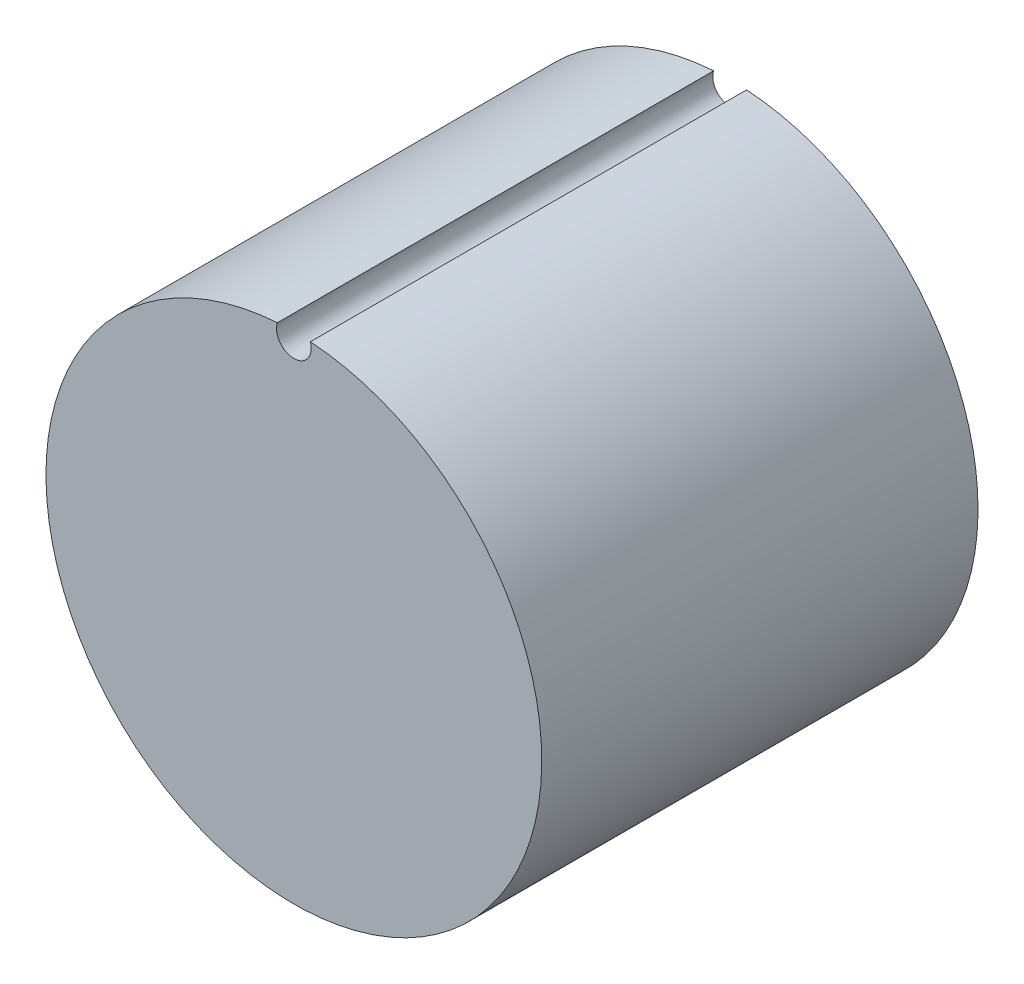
ISO-10303-21;
HEADER;
FILE_DESCRIPTION(('STEP AP214'),'2;1');
FILE_NAME('part.step','',(''),(''),'','','');
FILE_SCHEMA(('AUTOMOTIVE_DESIGN { 1 0 10303 214 1 1 1 1 }'));
ENDSEC;
DATA;
#1=APPLICATION_CONTEXT('core data for automotive mechanical design processes');
#2=APPLICATION_PROTOCOL_DEFINITION('international standard','automotive_design',2000,#1);
#3=PRODUCT_CONTEXT('',#1,'mechanical');
#4=PRODUCT('Part','Part','',(#3));
#5=PRODUCT_RELATED_PRODUCT_CATEGORY('part','',(#4));
#6=PRODUCT_DEFINITION_FORMATION('','',#4);
#7=PRODUCT_DEFINITION_CONTEXT('part definition',#1,'design');
#8=PRODUCT_DEFINITION('design','',#6,#7);
#9=PRODUCT_DEFINITION_SHAPE('','',#8);
#10=(LENGTH_UNIT() NAMED_UNIT(*) SI_UNIT(.MILLI.,.METRE.));
#11=(NAMED_UNIT(*) PLANE_ANGLE_UNIT() SI_UNIT($,.RADIAN.));
#12=(NAMED_UNIT(*) SI_UNIT($,.STERADIAN.) SOLID_ANGLE_UNIT());
#13=UNCERTAINTY_MEASURE_WITH_UNIT(LENGTH_MEASURE(1.E-05),#10,'distance_accuracy_value','');
#14=(GEOMETRIC_REPRESENTATION_CONTEXT(3) GLOBAL_UNCERTAINTY_ASSIGNED_CONTEXT((#13)) GLOBAL_UNIT_ASSIGNED_CONTEXT((#10,
#11,#12)) REPRESENTATION_CONTEXT('',''));
#15=CARTESIAN_POINT('',(0.,0.,0.));
#16=DIRECTION('',(0.,0.,1.));
#17=DIRECTION('',(1.,0.,0.));
#18=AXIS2_PLACEMENT_3D('',#15,#16,#17);
#19=CARTESIAN_POINT('',(0.,0.,22.));
#20=DIRECTION('',(0.,0.,-1.));
#21=DIRECTION('',(-1.,0.,0.));
#22=AXIS2_PLACEMENT_3D('',#19,#20,#21);
#23=CYLINDRICAL_SURFACE('',#22,12.5);
#24=CARTESIAN_POINT('',(0.,0.,0.));
#25=DIRECTION('',(0.,0.,1.));
#26=DIRECTION('',(1.,0.,0.));
#27=AXIS2_PLACEMENT_3D('',#24,#25,#26);
#28=CIRCLE('',#27,12.5);
#29=CARTESIAN_POINT('',(-0.831547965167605,12.4723104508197,0.));
#30=VERTEX_POINT('',#29);
#31=CARTESIAN_POINT('',(0.8315479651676,12.4723104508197,0.));
#32=VERTEX_POINT('',#31);
#33=EDGE_CURVE('E73',#30,#32,#28,.T.);
#34=ORIENTED_EDGE('',*,*,#33,.T.);
#35=DIRECTION('',(0.,0.,1.));
#36=VECTOR('',#35,1.);
#37=CARTESIAN_POINT('',(0.831547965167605,12.4723104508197,11.));
#38=LINE('',#37,#36);
#39=CARTESIAN_POINT('',(0.831547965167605,12.4723104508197,22.));
#40=VERTEX_POINT('',#39);
#41=EDGE_CURVE('E58',#32,#40,#38,.T.);
#42=ORIENTED_EDGE('',*,*,#41,.T.);
#43=CARTESIAN_POINT('',(0.,0.,22.));
#44=DIRECTION('',(0.,0.,1.));
#45=DIRECTION('',(1.,0.,0.));
#46=AXIS2_PLACEMENT_3D('',#43,#44,#45);
#47=CIRCLE('',#46,12.5);
#48=CARTESIAN_POINT('',(-0.831547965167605,12.4723104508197,22.));
#49=VERTEX_POINT('',#48);
#50=EDGE_CURVE('E51',#49,#40,#47,.T.);
#51=ORIENTED_EDGE('',*,*,#50,.F.);
#52=DIRECTION('',(0.,0.,1.));
#53=VECTOR('',#52,1.);
#54=CARTESIAN_POINT('',(-0.831547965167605,12.4723104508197,11.));
#55=LINE('',#54,#53);
#56=EDGE_CURVE('E62',#49,#30,#55,.F.);
#57=ORIENTED_EDGE('',*,*,#56,.T.);
#58=EDGE_LOOP('',(#34,#42,#51,#57));
#59=FACE_BOUND('',#58,.T.);
#60=ADVANCED_FACE('F43',(#59),#23,.T.);
#61=CARTESIAN_POINT('',(0.,0.,22.));
#62=DIRECTION('',(0.,0.,1.));
#63=DIRECTION('',(1.,0.,0.));
#64=AXIS2_PLACEMENT_3D('',#61,#62,#63);
#65=PLANE('',#64);
#66=CARTESIAN_POINT('',(0.,12.2,22.));
#67=DIRECTION('',(0.,0.,1.));
#68=DIRECTION('',(1.,0.,0.));
#69=AXIS2_PLACEMENT_3D('',#66,#67,#68);
#70=CIRCLE('',#69,0.875);
#71=EDGE_CURVE('E76',#49,#40,#70,.T.);
#72=ORIENTED_EDGE('',*,*,#71,.F.);
#73=ORIENTED_EDGE('',*,*,#50,.T.);
#74=EDGE_LOOP('',(#72,#73));
#75=FACE_BOUND('',#74,.T.);
#76=ADVANCED_FACE('F107',(#75),#65,.T.);
#77=CARTESIAN_POINT('',(0.,0.,0.));
#78=DIRECTION('',(0.,0.,1.));
#79=DIRECTION('',(1.,0.,0.));
#80=AXIS2_PLACEMENT_3D('',#77,#78,#79);
#81=PLANE('',#80);
#82=CARTESIAN_POINT('',(0.,0.,0.));
#83=DIRECTION('',(0.,0.,-1.));
#84=DIRECTION('',(-1.,0.,0.));
#85=AXIS2_PLACEMENT_3D('',#82,#83,#84);
#86=CIRCLE('',#85,8.5);
#87=CARTESIAN_POINT('',(-8.5,0.,0.));
#88=VERTEX_POINT('',#87);
#89=EDGE_CURVE('E95',#88,#88,#86,.T.);
#90=ORIENTED_EDGE('',*,*,#89,.F.);
#91=EDGE_LOOP('',(#90));
#92=FACE_BOUND('',#91,.T.);
#93=ORIENTED_EDGE('',*,*,#33,.F.);
#94=CARTESIAN_POINT('',(0.,12.2,0.));
#95=DIRECTION('',(0.,0.,1.));
#96=DIRECTION('',(1.,0.,0.));
#97=AXIS2_PLACEMENT_3D('',#94,#95,#96);
#98=CIRCLE('',#97,0.875);
#99=EDGE_CURVE('E11',#30,#32,#98,.T.);
#100=ORIENTED_EDGE('',*,*,#99,.T.);
#101=EDGE_LOOP('',(#93,#100));
#102=FACE_BOUND('',#101,.T.);
#103=ADVANCED_FACE('F78',(#92,#102),#81,.F.);
#104=CARTESIAN_POINT('',(0.,0.,7.));
#105=DIRECTION('',(0.,0.,-1.));
#106=DIRECTION('',(-1.,0.,0.));
#107=AXIS2_PLACEMENT_3D('',#104,#105,#106);
#108=PLANE('',#107);
#109=CARTESIAN_POINT('',(0.,0.,7.));
#110=DIRECTION('',(0.,0.,-1.));
#111=DIRECTION('',(-1.,0.,0.));
#112=AXIS2_PLACEMENT_3D('',#109,#110,#111);
#113=CIRCLE('',#112,8.5);
#114=CARTESIAN_POINT('',(-8.5,0.,7.));
#115=VERTEX_POINT('',#114);
#116=EDGE_CURVE('E90',#115,#115,#113,.T.);
#117=ORIENTED_EDGE('',*,*,#116,.T.);
#118=EDGE_LOOP('',(#117));
#119=FACE_BOUND('',#118,.T.);
#120=CARTESIAN_POINT('',(0.,0.,7.));
#121=DIRECTION('',(0.,0.,-1.));
#122=DIRECTION('',(-1.,0.,0.));
#123=AXIS2_PLACEMENT_3D('',#120,#121,#122);
#124=CIRCLE('',#123,3.);
#125=CARTESIAN_POINT('',(-3.,0.,7.));
#126=VERTEX_POINT('',#125);
#127=EDGE_CURVE('E86',#126,#126,#124,.F.);
#128=ORIENTED_EDGE('',*,*,#127,.T.);
#129=EDGE_LOOP('',(#128));
#130=FACE_BOUND('',#129,.T.);
#131=ADVANCED_FACE('F114',(#119,#130),#108,.T.);
#132=CARTESIAN_POINT('',(0.,0.,7.));
#133=DIRECTION('',(0.,0.,-1.));
#134=DIRECTION('',(-1.,0.,0.));
#135=AXIS2_PLACEMENT_3D('',#132,#133,#134);
#136=CYLINDRICAL_SURFACE('',#135,8.5);
#137=ORIENTED_EDGE('',*,*,#116,.F.);
#138=EDGE_LOOP('',(#137));
#139=FACE_BOUND('',#138,.T.);
#140=ORIENTED_EDGE('',*,*,#89,.T.);
#141=EDGE_LOOP('',(#140));
#142=FACE_BOUND('',#141,.T.);
#143=ADVANCED_FACE('F124',(#139,#142),#136,.F.);
#144=CARTESIAN_POINT('',(0.,0.,19.));
#145=DIRECTION('',(0.,0.,-1.));
#146=DIRECTION('',(-1.,0.,0.));
#147=AXIS2_PLACEMENT_3D('',#144,#145,#146);
#148=PLANE('',#147);
#149=CARTESIAN_POINT('',(0.,0.,19.));
#150=DIRECTION('',(0.,0.,-1.));
#151=DIRECTION('',(-1.,0.,0.));
#152=AXIS2_PLACEMENT_3D('',#149,#150,#151);
#153=CIRCLE('',#152,3.);
#154=CARTESIAN_POINT('',(-3.,0.,19.));
#155=VERTEX_POINT('',#154);
#156=EDGE_CURVE('E80',#155,#155,#153,.T.);
#157=ORIENTED_EDGE('',*,*,#156,.T.);
#158=EDGE_LOOP('',(#157));
#159=FACE_BOUND('',#158,.T.);
#160=ADVANCED_FACE('F120',(#159),#148,.T.);
#161=CARTESIAN_POINT('',(0.,0.,19.));
#162=DIRECTION('',(0.,0.,-1.));
#163=DIRECTION('',(-1.,0.,0.));
#164=AXIS2_PLACEMENT_3D('',#161,#162,#163);
#165=CYLINDRICAL_SURFACE('',#164,3.);
#166=ORIENTED_EDGE('',*,*,#156,.F.);
#167=EDGE_LOOP('',(#166));
#168=FACE_BOUND('',#167,.T.);
#169=ORIENTED_EDGE('',*,*,#127,.F.);
#170=EDGE_LOOP('',(#169));
#171=FACE_BOUND('',#170,.T.);
#172=ADVANCED_FACE('F117',(#168,#171),#165,.F.);
#173=CARTESIAN_POINT('',(0.,12.2,0.));
#174=DIRECTION('',(0.,0.,1.));
#175=DIRECTION('',(1.,0.,0.));
#176=AXIS2_PLACEMENT_3D('',#173,#174,#175);
#177=CYLINDRICAL_SURFACE('',#176,0.875);
#178=ORIENTED_EDGE('',*,*,#99,.F.);
#179=ORIENTED_EDGE('',*,*,#56,.F.);
#180=ORIENTED_EDGE('',*,*,#71,.T.);
#181=ORIENTED_EDGE('',*,*,#41,.F.);
#182=EDGE_LOOP('',(#178,#179,#180,#181));
#183=FACE_BOUND('',#182,.T.);
#184=ADVANCED_FACE('F67',(#183),#177,.F.);
#185=CLOSED_SHELL('',(#60,#76,#103,#131,#143,#160,#172,#184));
#186=MANIFOLD_SOLID_BREP('B2',#185);
#187=ADVANCED_BREP_SHAPE_REPRESENTATION('',(#18,#186),#14);
#188=SHAPE_DEFINITION_REPRESENTATION(#9,#187);
ENDSEC;
END-ISO-10303-21;
